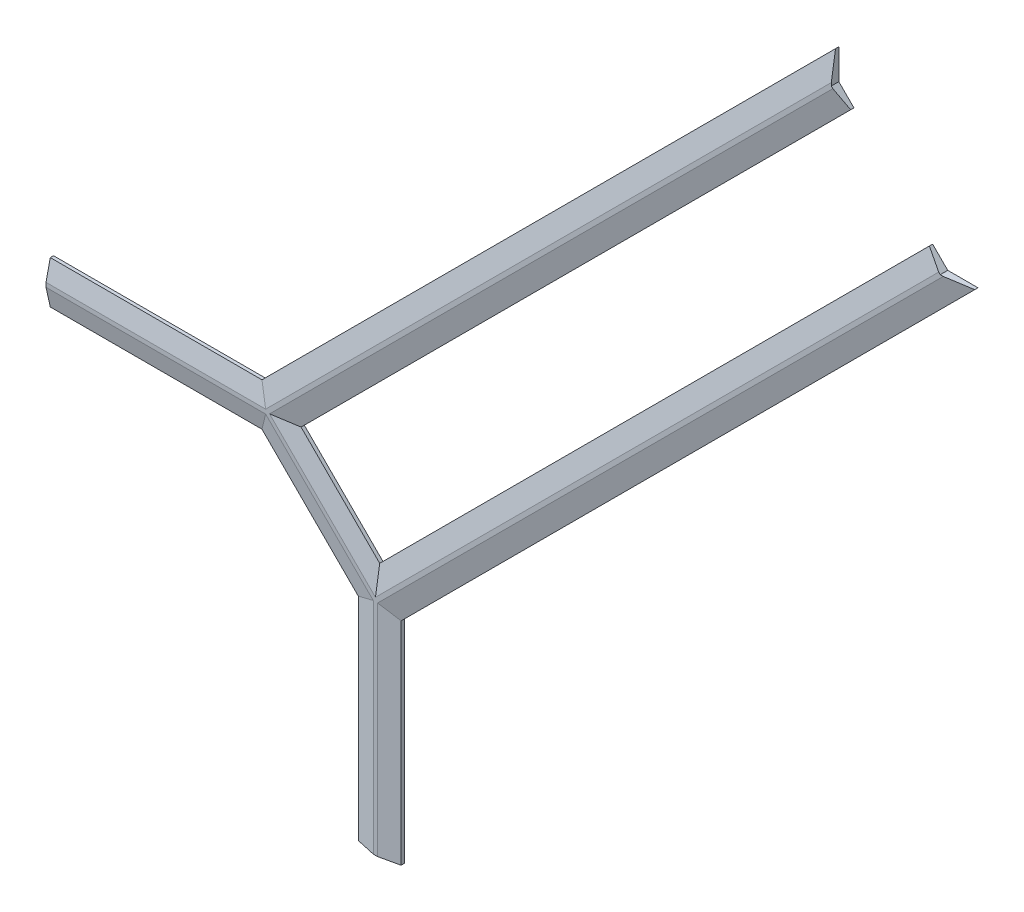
ISO-10303-21;
HEADER;
FILE_DESCRIPTION(('STEP AP214'),'2;1');
FILE_NAME('part.step','',(''),(''),'','','');
FILE_SCHEMA(('AUTOMOTIVE_DESIGN { 1 0 10303 214 1 1 1 1 }'));
ENDSEC;
DATA;
#1=APPLICATION_CONTEXT('core data for automotive mechanical design processes');
#2=APPLICATION_PROTOCOL_DEFINITION('international standard','automotive_design',2000,#1);
#3=PRODUCT_CONTEXT('',#1,'mechanical');
#4=PRODUCT('Part','Part','',(#3));
#5=PRODUCT_RELATED_PRODUCT_CATEGORY('part','',(#4));
#6=PRODUCT_DEFINITION_FORMATION('','',#4);
#7=PRODUCT_DEFINITION_CONTEXT('part definition',#1,'design');
#8=PRODUCT_DEFINITION('design','',#6,#7);
#9=PRODUCT_DEFINITION_SHAPE('','',#8);
#10=(LENGTH_UNIT() NAMED_UNIT(*) SI_UNIT(.MILLI.,.METRE.));
#11=(NAMED_UNIT(*) PLANE_ANGLE_UNIT() SI_UNIT($,.RADIAN.));
#12=(NAMED_UNIT(*) SI_UNIT($,.STERADIAN.) SOLID_ANGLE_UNIT());
#13=UNCERTAINTY_MEASURE_WITH_UNIT(LENGTH_MEASURE(1.E-05),#10,'distance_accuracy_value','');
#14=(GEOMETRIC_REPRESENTATION_CONTEXT(3) GLOBAL_UNCERTAINTY_ASSIGNED_CONTEXT((#13)) GLOBAL_UNIT_ASSIGNED_CONTEXT((#10,
#11,#12)) REPRESENTATION_CONTEXT('',''));
#15=CARTESIAN_POINT('',(0.,0.,0.));
#16=DIRECTION('',(0.,0.,1.));
#17=DIRECTION('',(1.,0.,0.));
#18=AXIS2_PLACEMENT_3D('',#15,#16,#17);
#19=CARTESIAN_POINT('',(807.010779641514,1220.1025612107,22.352));
#20=DIRECTION('',(-1.,1.1744786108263E-13,0.));
#21=DIRECTION('',(-1.1744786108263E-13,-1.,0.));
#22=AXIS2_PLACEMENT_3D('',#19,#20,#21);
#23=PLANE('',#22);
#24=DIRECTION('',(0.,0.,-1.));
#25=VECTOR('',#24,1.);
#26=CARTESIAN_POINT('',(807.010779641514,1220.1025612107,22.352));
#27=LINE('',#26,#25);
#28=CARTESIAN_POINT('',(807.010779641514,1220.1025612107,9.65199999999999));
#29=VERTEX_POINT('',#28);
#30=CARTESIAN_POINT('',(807.010779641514,1220.1025612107,0.));
#31=VERTEX_POINT('',#30);
#32=EDGE_CURVE('E293',#29,#31,#27,.T.);
#33=ORIENTED_EDGE('',*,*,#32,.F.);
#34=DIRECTION('',(-1.16024198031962E-13,-0.987878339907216,0.155230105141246));
#35=VECTOR('',#34,1.);
#36=CARTESIAN_POINT('',(807.010779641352,-160.272158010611,226.556961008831));
#37=LINE('',#36,#35);
#38=CARTESIAN_POINT('',(807.010779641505,1139.28025612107,22.3520000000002));
#39=VERTEX_POINT('',#38);
#40=EDGE_CURVE('E11',#29,#39,#37,.T.);
#41=ORIENTED_EDGE('',*,*,#40,.T.);
#42=DIRECTION('',(1.1744786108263E-13,1.,0.));
#43=VECTOR('',#42,1.);
#44=CARTESIAN_POINT('',(807.010779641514,1220.1025612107,22.352));
#45=LINE('',#44,#43);
#46=CARTESIAN_POINT('',(807.010779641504,1130.3,22.352));
#47=VERTEX_POINT('',#46);
#48=EDGE_CURVE('E266',#47,#39,#45,.T.);
#49=ORIENTED_EDGE('',*,*,#48,.F.);
#50=DIRECTION('',(0.,0.,-1.));
#51=VECTOR('',#50,1.);
#52=CARTESIAN_POINT('',(807.010779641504,1130.3,22.352));
#53=LINE('',#52,#51);
#54=CARTESIAN_POINT('',(807.010779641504,1130.3,0.));
#55=VERTEX_POINT('',#54);
#56=EDGE_CURVE('E217',#47,#55,#53,.T.);
#57=ORIENTED_EDGE('',*,*,#56,.T.);
#58=DIRECTION('',(1.1744786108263E-13,1.,0.));
#59=VECTOR('',#58,1.);
#60=CARTESIAN_POINT('',(807.010779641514,1220.1025612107,0.));
#61=LINE('',#60,#59);
#62=EDGE_CURVE('E221',#55,#31,#61,.T.);
#63=ORIENTED_EDGE('',*,*,#62,.T.);
#64=EDGE_LOOP('',(#33,#41,#49,#57,#63));
#65=FACE_BOUND('',#64,.T.);
#66=ADVANCED_FACE('F31',(#65),#23,.F.);
#67=CARTESIAN_POINT('',(807.010779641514,1220.1025612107,22.352));
#68=DIRECTION('',(0.707106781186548,-0.707106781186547,0.));
#69=DIRECTION('',(0.707106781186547,0.707106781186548,0.));
#70=AXIS2_PLACEMENT_3D('',#67,#68,#69);
#71=PLANE('',#70);
#72=DIRECTION('',(0.,0.,-1.));
#73=VECTOR('',#72,1.);
#74=CARTESIAN_POINT('',(-895.691781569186,-482.599999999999,22.352));
#75=LINE('',#74,#73);
#76=CARTESIAN_POINT('',(-895.691781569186,-482.599999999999,9.65199999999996));
#77=VERTEX_POINT('',#76);
#78=CARTESIAN_POINT('',(-895.691781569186,-482.599999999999,0.));
#79=VERTEX_POINT('',#78);
#80=EDGE_CURVE('E291',#77,#79,#75,.T.);
#81=ORIENTED_EDGE('',*,*,#80,.F.);
#82=DIRECTION('',(0.707106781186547,0.707106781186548,0.));
#83=VECTOR('',#82,1.);
#84=CARTESIAN_POINT('',(807.010779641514,1220.1025612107,9.65199999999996));
#85=LINE('',#84,#83);
#86=EDGE_CURVE('E40',#77,#29,#85,.T.);
#87=ORIENTED_EDGE('',*,*,#86,.T.);
#88=ORIENTED_EDGE('',*,*,#32,.T.);
#89=DIRECTION('',(-0.707106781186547,-0.707106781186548,0.));
#90=VECTOR('',#89,1.);
#91=CARTESIAN_POINT('',(807.010779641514,1220.1025612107,0.));
#92=LINE('',#91,#90);
#93=EDGE_CURVE('E224',#31,#79,#92,.T.);
#94=ORIENTED_EDGE('',*,*,#93,.T.);
#95=EDGE_LOOP('',(#81,#87,#88,#94));
#96=FACE_BOUND('',#95,.T.);
#97=ADVANCED_FACE('F412',(#96),#71,.F.);
#98=CARTESIAN_POINT('',(-1524.,-482.6,22.352));
#99=DIRECTION('',(0.,-1.,0.));
#100=DIRECTION('',(1.,0.,0.));
#101=AXIS2_PLACEMENT_3D('',#98,#99,#100);
#102=PLANE('',#101);
#103=DIRECTION('',(0.,0.,-1.));
#104=VECTOR('',#103,1.);
#105=CARTESIAN_POINT('',(-1524.,-482.6,22.352));
#106=LINE('',#105,#104);
#107=CARTESIAN_POINT('',(-1524.,-482.6,9.65199999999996));
#108=VERTEX_POINT('',#107);
#109=CARTESIAN_POINT('',(-1524.,-482.6,0.));
#110=VERTEX_POINT('',#109);
#111=EDGE_CURVE('E289',#108,#110,#106,.T.);
#112=ORIENTED_EDGE('',*,*,#111,.F.);
#113=DIRECTION('',(1.,0.,0.));
#114=VECTOR('',#113,1.);
#115=CARTESIAN_POINT('',(-895.691781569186,-482.599999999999,9.65199999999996));
#116=LINE('',#115,#114);
#117=EDGE_CURVE('E55',#108,#77,#116,.T.);
#118=ORIENTED_EDGE('',*,*,#117,.T.);
#119=ORIENTED_EDGE('',*,*,#80,.T.);
#120=DIRECTION('',(-1.,0.,0.));
#121=VECTOR('',#120,1.);
#122=CARTESIAN_POINT('',(-1524.,-482.6,0.));
#123=LINE('',#122,#121);
#124=EDGE_CURVE('E228',#79,#110,#123,.T.);
#125=ORIENTED_EDGE('',*,*,#124,.T.);
#126=EDGE_LOOP('',(#112,#118,#119,#125));
#127=FACE_BOUND('',#126,.T.);
#128=ADVANCED_FACE('F417',(#127),#102,.F.);
#129=CARTESIAN_POINT('',(-1524.,-482.6,22.352));
#130=DIRECTION('',(1.,0.,0.));
#131=DIRECTION('',(0.,0.,-1.));
#132=AXIS2_PLACEMENT_3D('',#129,#130,#131);
#133=PLANE('',#132);
#134=DIRECTION('',(0.,0.,-1.));
#135=VECTOR('',#134,1.);
#136=CARTESIAN_POINT('',(-1524.,-609.599999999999,22.352));
#137=LINE('',#136,#135);
#138=CARTESIAN_POINT('',(-1524.,-609.599999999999,9.65199999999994));
#139=VERTEX_POINT('',#138);
#140=CARTESIAN_POINT('',(-1524.,-609.599999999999,0.));
#141=VERTEX_POINT('',#140);
#142=EDGE_CURVE('E287',#139,#141,#137,.T.);
#143=ORIENTED_EDGE('',*,*,#142,.F.);
#144=DIRECTION('',(0.,0.976187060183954,0.216930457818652));
#145=VECTOR('',#144,1.);
#146=CARTESIAN_POINT('',(-1524.,-552.449999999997,22.3520000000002));
#147=LINE('',#146,#145);
#148=CARTESIAN_POINT('',(-1524.,-552.449999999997,22.352));
#149=VERTEX_POINT('',#148);
#150=EDGE_CURVE('E338',#139,#149,#147,.T.);
#151=ORIENTED_EDGE('',*,*,#150,.T.);
#152=DIRECTION('',(0.,-1.,0.));
#153=VECTOR('',#152,1.);
#154=CARTESIAN_POINT('',(-1524.,-482.6,22.352));
#155=LINE('',#154,#153);
#156=CARTESIAN_POINT('',(-1524.,-539.750000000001,22.352));
#157=VERTEX_POINT('',#156);
#158=EDGE_CURVE('E376',#157,#149,#155,.T.);
#159=ORIENTED_EDGE('',*,*,#158,.F.);
#160=DIRECTION('',(0.,0.976187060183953,-0.216930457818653));
#161=VECTOR('',#160,1.);
#162=CARTESIAN_POINT('',(-1524.,-539.75,22.3519999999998));
#163=LINE('',#162,#161);
#164=EDGE_CURVE('E336',#157,#108,#163,.T.);
#165=ORIENTED_EDGE('',*,*,#164,.T.);
#166=ORIENTED_EDGE('',*,*,#111,.T.);
#167=DIRECTION('',(0.,-1.,0.));
#168=VECTOR('',#167,1.);
#169=CARTESIAN_POINT('',(-1524.,-482.6,0.));
#170=LINE('',#169,#168);
#171=EDGE_CURVE('E231',#110,#141,#170,.T.);
#172=ORIENTED_EDGE('',*,*,#171,.T.);
#173=EDGE_LOOP('',(#143,#151,#159,#165,#166,#172));
#174=FACE_BOUND('',#173,.T.);
#175=ADVANCED_FACE('F449',(#174),#133,.F.);
#176=CARTESIAN_POINT('',(-1524.,-609.599999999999,22.352));
#177=DIRECTION('',(0.,1.,0.));
#178=DIRECTION('',(-1.,0.,0.));
#179=AXIS2_PLACEMENT_3D('',#176,#177,#178);
#180=PLANE('',#179);
#181=DIRECTION('',(0.,0.,-1.));
#182=VECTOR('',#181,1.);
#183=CARTESIAN_POINT('',(-895.691781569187,-609.599999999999,22.352));
#184=LINE('',#183,#182);
#185=CARTESIAN_POINT('',(-895.691781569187,-609.599999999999,9.65199999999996));
#186=VERTEX_POINT('',#185);
#187=CARTESIAN_POINT('',(-895.691781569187,-609.599999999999,0.));
#188=VERTEX_POINT('',#187);
#189=EDGE_CURVE('E285',#186,#188,#184,.T.);
#190=ORIENTED_EDGE('',*,*,#189,.F.);
#191=DIRECTION('',(-1.,0.,0.));
#192=VECTOR('',#191,1.);
#193=CARTESIAN_POINT('',(-1524.,-609.599999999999,9.65199999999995));
#194=LINE('',#193,#192);
#195=EDGE_CURVE('E334',#186,#139,#194,.T.);
#196=ORIENTED_EDGE('',*,*,#195,.T.);
#197=ORIENTED_EDGE('',*,*,#142,.T.);
#198=DIRECTION('',(1.,0.,0.));
#199=VECTOR('',#198,1.);
#200=CARTESIAN_POINT('',(-1524.,-609.599999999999,0.));
#201=LINE('',#200,#199);
#202=EDGE_CURVE('E234',#141,#188,#201,.T.);
#203=ORIENTED_EDGE('',*,*,#202,.T.);
#204=EDGE_LOOP('',(#190,#196,#197,#203));
#205=FACE_BOUND('',#204,.T.);
#206=ADVANCED_FACE('F486',(#205),#180,.F.);
#207=CARTESIAN_POINT('',(-895.691781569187,-609.599999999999,22.352));
#208=DIRECTION('',(0.707106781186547,0.707106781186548,0.));
#209=DIRECTION('',(-0.707106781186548,0.707106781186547,0.));
#210=AXIS2_PLACEMENT_3D('',#207,#208,#209);
#211=PLANE('',#210);
#212=DIRECTION('',(0.,0.,-1.));
#213=VECTOR('',#212,1.);
#214=CARTESIAN_POINT('',(-609.6,-895.691781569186,22.352));
#215=LINE('',#214,#213);
#216=CARTESIAN_POINT('',(-609.6,-895.691781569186,9.65199999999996));
#217=VERTEX_POINT('',#216);
#218=CARTESIAN_POINT('',(-609.6,-895.691781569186,0.));
#219=VERTEX_POINT('',#218);
#220=EDGE_CURVE('E283',#217,#219,#215,.T.);
#221=ORIENTED_EDGE('',*,*,#220,.F.);
#222=DIRECTION('',(-0.707106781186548,0.707106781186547,0.));
#223=VECTOR('',#222,1.);
#224=CARTESIAN_POINT('',(-895.691781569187,-609.599999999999,9.65199999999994));
#225=LINE('',#224,#223);
#226=EDGE_CURVE('E332',#217,#186,#225,.T.);
#227=ORIENTED_EDGE('',*,*,#226,.T.);
#228=ORIENTED_EDGE('',*,*,#189,.T.);
#229=DIRECTION('',(0.707106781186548,-0.707106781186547,0.));
#230=VECTOR('',#229,1.);
#231=CARTESIAN_POINT('',(-895.691781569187,-609.599999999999,0.));
#232=LINE('',#231,#230);
#233=EDGE_CURVE('E237',#188,#219,#232,.T.);
#234=ORIENTED_EDGE('',*,*,#233,.T.);
#235=EDGE_LOOP('',(#221,#227,#228,#234));
#236=FACE_BOUND('',#235,.T.);
#237=ADVANCED_FACE('F488',(#236),#211,.F.);
#238=CARTESIAN_POINT('',(-609.6,-895.691781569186,22.352));
#239=DIRECTION('',(1.,0.,0.));
#240=DIRECTION('',(0.,1.,0.));
#241=AXIS2_PLACEMENT_3D('',#238,#239,#240);
#242=PLANE('',#241);
#243=DIRECTION('',(0.,0.,-1.));
#244=VECTOR('',#243,1.);
#245=CARTESIAN_POINT('',(-609.6,-1524.,22.352));
#246=LINE('',#245,#244);
#247=CARTESIAN_POINT('',(-609.6,-1524.,9.65199999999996));
#248=VERTEX_POINT('',#247);
#249=CARTESIAN_POINT('',(-609.6,-1524.,0.));
#250=VERTEX_POINT('',#249);
#251=EDGE_CURVE('E281',#248,#250,#246,.T.);
#252=ORIENTED_EDGE('',*,*,#251,.F.);
#253=DIRECTION('',(0.,1.,0.));
#254=VECTOR('',#253,1.);
#255=CARTESIAN_POINT('',(-609.6,-895.691781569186,9.65199999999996));
#256=LINE('',#255,#254);
#257=EDGE_CURVE('E330',#248,#217,#256,.T.);
#258=ORIENTED_EDGE('',*,*,#257,.T.);
#259=ORIENTED_EDGE('',*,*,#220,.T.);
#260=DIRECTION('',(0.,-1.,0.));
#261=VECTOR('',#260,1.);
#262=CARTESIAN_POINT('',(-609.6,-895.691781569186,0.));
#263=LINE('',#262,#261);
#264=EDGE_CURVE('E240',#219,#250,#263,.T.);
#265=ORIENTED_EDGE('',*,*,#264,.T.);
#266=EDGE_LOOP('',(#252,#258,#259,#265));
#267=FACE_BOUND('',#266,.T.);
#268=ADVANCED_FACE('F456',(#267),#242,.F.);
#269=CARTESIAN_POINT('',(-609.6,-1524.,22.352));
#270=DIRECTION('',(0.,1.,0.));
#271=DIRECTION('',(0.,0.,1.));
#272=AXIS2_PLACEMENT_3D('',#269,#270,#271);
#273=PLANE('',#272);
#274=DIRECTION('',(1.,0.,0.));
#275=VECTOR('',#274,1.);
#276=CARTESIAN_POINT('',(-609.6,-1524.,22.352));
#277=LINE('',#276,#275);
#278=CARTESIAN_POINT('',(-552.449999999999,-1524.,22.352));
#279=VERTEX_POINT('',#278);
#280=CARTESIAN_POINT('',(-539.750000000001,-1524.,22.352));
#281=VERTEX_POINT('',#280);
#282=EDGE_CURVE('E198',#279,#281,#277,.T.);
#283=ORIENTED_EDGE('',*,*,#282,.F.);
#284=DIRECTION('',(-0.976187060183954,0.,-0.216930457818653));
#285=VECTOR('',#284,1.);
#286=CARTESIAN_POINT('',(-552.449999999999,-1524.,22.352));
#287=LINE('',#286,#285);
#288=EDGE_CURVE('E328',#279,#248,#287,.T.);
#289=ORIENTED_EDGE('',*,*,#288,.T.);
#290=ORIENTED_EDGE('',*,*,#251,.T.);
#291=DIRECTION('',(1.,0.,0.));
#292=VECTOR('',#291,1.);
#293=CARTESIAN_POINT('',(-609.6,-1524.,0.));
#294=LINE('',#293,#292);
#295=CARTESIAN_POINT('',(-482.6,-1524.,0.));
#296=VERTEX_POINT('',#295);
#297=EDGE_CURVE('E243',#250,#296,#294,.T.);
#298=ORIENTED_EDGE('',*,*,#297,.T.);
#299=DIRECTION('',(0.,0.,-1.));
#300=VECTOR('',#299,1.);
#301=CARTESIAN_POINT('',(-482.6,-1524.,22.352));
#302=LINE('',#301,#300);
#303=CARTESIAN_POINT('',(-482.6,-1524.,9.65199999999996));
#304=VERTEX_POINT('',#303);
#305=EDGE_CURVE('E279',#304,#296,#302,.T.);
#306=ORIENTED_EDGE('',*,*,#305,.F.);
#307=DIRECTION('',(-0.976187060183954,0.,0.216930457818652));
#308=VECTOR('',#307,1.);
#309=CARTESIAN_POINT('',(-539.750000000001,-1524.,22.352));
#310=LINE('',#309,#308);
#311=EDGE_CURVE('E326',#304,#281,#310,.T.);
#312=ORIENTED_EDGE('',*,*,#311,.T.);
#313=EDGE_LOOP('',(#283,#289,#290,#298,#306,#312));
#314=FACE_BOUND('',#313,.T.);
#315=ADVANCED_FACE('F387',(#314),#273,.F.);
#316=CARTESIAN_POINT('',(-482.6,-895.691781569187,22.352));
#317=DIRECTION('',(-1.,0.,0.));
#318=DIRECTION('',(0.,-1.,0.));
#319=AXIS2_PLACEMENT_3D('',#316,#317,#318);
#320=PLANE('',#319);
#321=DIRECTION('',(0.,0.,-1.));
#322=VECTOR('',#321,1.);
#323=CARTESIAN_POINT('',(-482.6,-895.691781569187,22.352));
#324=LINE('',#323,#322);
#325=CARTESIAN_POINT('',(-482.6,-895.691781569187,9.65199999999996));
#326=VERTEX_POINT('',#325);
#327=CARTESIAN_POINT('',(-482.6,-895.691781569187,0.));
#328=VERTEX_POINT('',#327);
#329=EDGE_CURVE('E277',#326,#328,#324,.T.);
#330=ORIENTED_EDGE('',*,*,#329,.F.);
#331=DIRECTION('',(0.,-1.,0.));
#332=VECTOR('',#331,1.);
#333=CARTESIAN_POINT('',(-482.6,-1524.,9.65199999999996));
#334=LINE('',#333,#332);
#335=EDGE_CURVE('E340',#326,#304,#334,.T.);
#336=ORIENTED_EDGE('',*,*,#335,.T.);
#337=ORIENTED_EDGE('',*,*,#305,.T.);
#338=DIRECTION('',(0.,1.,0.));
#339=VECTOR('',#338,1.);
#340=CARTESIAN_POINT('',(-482.6,-895.691781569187,0.));
#341=LINE('',#340,#339);
#342=EDGE_CURVE('E246',#296,#328,#341,.T.);
#343=ORIENTED_EDGE('',*,*,#342,.T.);
#344=EDGE_LOOP('',(#330,#336,#337,#343));
#345=FACE_BOUND('',#344,.T.);
#346=ADVANCED_FACE('F392',(#345),#320,.F.);
#347=CARTESIAN_POINT('',(1220.10256121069,807.010779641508,22.352));
#348=DIRECTION('',(-0.707106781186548,0.707106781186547,0.));
#349=DIRECTION('',(-0.707106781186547,-0.707106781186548,0.));
#350=AXIS2_PLACEMENT_3D('',#347,#348,#349);
#351=PLANE('',#350);
#352=DIRECTION('',(0.,0.,-1.));
#353=VECTOR('',#352,1.);
#354=CARTESIAN_POINT('',(1220.10256121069,807.010779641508,22.352));
#355=LINE('',#354,#353);
#356=CARTESIAN_POINT('',(1220.10256121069,807.010779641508,9.65199999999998));
#357=VERTEX_POINT('',#356);
#358=CARTESIAN_POINT('',(1220.10256121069,807.010779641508,0.));
#359=VERTEX_POINT('',#358);
#360=EDGE_CURVE('E208',#357,#359,#355,.T.);
#361=ORIENTED_EDGE('',*,*,#360,.F.);
#362=DIRECTION('',(-0.707106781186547,-0.707106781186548,0.));
#363=VECTOR('',#362,1.);
#364=CARTESIAN_POINT('',(-482.6,-895.691781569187,9.65199999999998));
#365=LINE('',#364,#363);
#366=EDGE_CURVE('E344',#357,#326,#365,.T.);
#367=ORIENTED_EDGE('',*,*,#366,.T.);
#368=ORIENTED_EDGE('',*,*,#329,.T.);
#369=DIRECTION('',(0.707106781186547,0.707106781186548,0.));
#370=VECTOR('',#369,1.);
#371=CARTESIAN_POINT('',(1220.10256121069,807.010779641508,0.));
#372=LINE('',#371,#370);
#373=EDGE_CURVE('E249',#328,#359,#372,.T.);
#374=ORIENTED_EDGE('',*,*,#373,.T.);
#375=EDGE_LOOP('',(#361,#367,#368,#374));
#376=FACE_BOUND('',#375,.T.);
#377=ADVANCED_FACE('F396',(#376),#351,.F.);
#378=CARTESIAN_POINT('',(1130.3,807.010779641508,22.352));
#379=DIRECTION('',(0.,-1.,0.));
#380=DIRECTION('',(1.,0.,0.));
#381=AXIS2_PLACEMENT_3D('',#378,#379,#380);
#382=PLANE('',#381);
#383=DIRECTION('',(-1.,0.,0.));
#384=VECTOR('',#383,1.);
#385=CARTESIAN_POINT('',(1130.3,807.010779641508,22.352));
#386=LINE('',#385,#384);
#387=CARTESIAN_POINT('',(1139.28025612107,807.010779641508,22.3519999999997));
#388=VERTEX_POINT('',#387);
#389=CARTESIAN_POINT('',(1130.3,807.010779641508,22.352));
#390=VERTEX_POINT('',#389);
#391=EDGE_CURVE('E187',#388,#390,#386,.T.);
#392=ORIENTED_EDGE('',*,*,#391,.F.);
#393=DIRECTION('',(0.987878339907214,0.,-0.155230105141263));
#394=VECTOR('',#393,1.);
#395=CARTESIAN_POINT('',(-160.272158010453,807.010779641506,226.556961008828));
#396=LINE('',#395,#394);
#397=EDGE_CURVE('E342',#388,#357,#396,.T.);
#398=ORIENTED_EDGE('',*,*,#397,.T.);
#399=ORIENTED_EDGE('',*,*,#360,.T.);
#400=DIRECTION('',(-1.,0.,0.));
#401=VECTOR('',#400,1.);
#402=CARTESIAN_POINT('',(1130.3,807.010779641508,0.));
#403=LINE('',#402,#401);
#404=CARTESIAN_POINT('',(1130.3,807.010779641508,0.));
#405=VERTEX_POINT('',#404);
#406=EDGE_CURVE('E204',#359,#405,#403,.T.);
#407=ORIENTED_EDGE('',*,*,#406,.T.);
#408=DIRECTION('',(0.,0.,-1.));
#409=VECTOR('',#408,1.);
#410=CARTESIAN_POINT('',(1130.3,807.010779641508,22.352));
#411=LINE('',#410,#409);
#412=EDGE_CURVE('E201',#390,#405,#411,.T.);
#413=ORIENTED_EDGE('',*,*,#412,.F.);
#414=EDGE_LOOP('',(#392,#398,#399,#407,#413));
#415=FACE_BOUND('',#414,.T.);
#416=ADVANCED_FACE('F202',(#415),#382,.F.);
#417=CARTESIAN_POINT('',(1085.39871939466,851.912060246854,22.352));
#418=DIRECTION('',(-0.707106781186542,-0.707106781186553,0.));
#419=DIRECTION('',(0.707106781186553,-0.707106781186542,0.));
#420=AXIS2_PLACEMENT_3D('',#417,#418,#419);
#421=PLANE('',#420);
#422=DIRECTION('',(0.,0.,-1.));
#423=VECTOR('',#422,1.);
#424=CARTESIAN_POINT('',(1085.39871939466,851.912060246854,22.352));
#425=LINE('',#424,#423);
#426=CARTESIAN_POINT('',(1085.39871939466,851.912060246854,9.6519999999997));
#427=VERTEX_POINT('',#426);
#428=CARTESIAN_POINT('',(1085.39871939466,851.912060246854,0.));
#429=VERTEX_POINT('',#428);
#430=EDGE_CURVE('E209',#427,#429,#425,.T.);
#431=ORIENTED_EDGE('',*,*,#430,.F.);
#432=DIRECTION('',(0.690268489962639,-0.690268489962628,0.216930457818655));
#433=VECTOR('',#432,1.);
#434=CARTESIAN_POINT('',(1125.80987193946,811.50090770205,22.3519999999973));
#435=LINE('',#434,#433);
#436=CARTESIAN_POINT('',(1125.80987193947,811.500907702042,22.352));
#437=VERTEX_POINT('',#436);
#438=EDGE_CURVE('E214',#427,#437,#435,.T.);
#439=ORIENTED_EDGE('',*,*,#438,.T.);
#440=DIRECTION('',(-0.707106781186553,0.707106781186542,0.));
#441=VECTOR('',#440,1.);
#442=CARTESIAN_POINT('',(1085.39871939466,851.912060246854,22.352));
#443=LINE('',#442,#441);
#444=EDGE_CURVE('E191',#390,#437,#443,.T.);
#445=ORIENTED_EDGE('',*,*,#444,.F.);
#446=ORIENTED_EDGE('',*,*,#412,.T.);
#447=DIRECTION('',(-0.707106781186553,0.707106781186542,0.));
#448=VECTOR('',#447,1.);
#449=CARTESIAN_POINT('',(1085.39871939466,851.912060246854,0.));
#450=LINE('',#449,#448);
#451=EDGE_CURVE('E253',#405,#429,#450,.T.);
#452=ORIENTED_EDGE('',*,*,#451,.T.);
#453=EDGE_LOOP('',(#431,#439,#445,#446,#452));
#454=FACE_BOUND('',#453,.T.);
#455=ADVANCED_FACE('F212',(#454),#421,.F.);
#456=CARTESIAN_POINT('',(1040.49743878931,807.010779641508,22.352));
#457=DIRECTION('',(0.707106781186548,-0.707106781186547,0.));
#458=DIRECTION('',(0.707106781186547,0.707106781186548,0.));
#459=AXIS2_PLACEMENT_3D('',#456,#457,#458);
#460=PLANE('',#459);
#461=DIRECTION('',(0.,0.,-1.));
#462=VECTOR('',#461,1.);
#463=CARTESIAN_POINT('',(-546.1,-779.586659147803,22.352));
#464=LINE('',#463,#462);
#465=CARTESIAN_POINT('',(-546.1,-779.586659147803,9.65199999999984));
#466=VERTEX_POINT('',#465);
#467=CARTESIAN_POINT('',(-546.1,-779.586659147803,0.));
#468=VERTEX_POINT('',#467);
#469=EDGE_CURVE('E273',#466,#468,#464,.T.);
#470=ORIENTED_EDGE('',*,*,#469,.F.);
#471=DIRECTION('',(0.707106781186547,0.707106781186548,0.));
#472=VECTOR('',#471,1.);
#473=CARTESIAN_POINT('',(1085.39871939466,851.912060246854,9.65199999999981));
#474=LINE('',#473,#472);
#475=EDGE_CURVE('E321',#466,#427,#474,.T.);
#476=ORIENTED_EDGE('',*,*,#475,.T.);
#477=ORIENTED_EDGE('',*,*,#430,.T.);
#478=DIRECTION('',(-0.707106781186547,-0.707106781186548,0.));
#479=VECTOR('',#478,1.);
#480=CARTESIAN_POINT('',(1040.49743878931,807.010779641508,0.));
#481=LINE('',#480,#479);
#482=EDGE_CURVE('E255',#429,#468,#481,.T.);
#483=ORIENTED_EDGE('',*,*,#482,.T.);
#484=EDGE_LOOP('',(#470,#476,#477,#483));
#485=FACE_BOUND('',#484,.T.);
#486=ADVANCED_FACE('F563',(#485),#460,.F.);
#487=CARTESIAN_POINT('',(-779.586659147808,-546.1,22.352));
#488=DIRECTION('',(-0.707106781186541,-0.707106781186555,0.));
#489=DIRECTION('',(0.707106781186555,-0.707106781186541,0.));
#490=AXIS2_PLACEMENT_3D('',#487,#488,#489);
#491=PLANE('',#490);
#492=DIRECTION('',(0.,0.,-1.));
#493=VECTOR('',#492,1.);
#494=CARTESIAN_POINT('',(-779.586659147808,-546.1,22.352));
#495=LINE('',#494,#493);
#496=CARTESIAN_POINT('',(-779.586659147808,-546.1,9.65199999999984));
#497=VERTEX_POINT('',#496);
#498=CARTESIAN_POINT('',(-779.586659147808,-546.1,0.));
#499=VERTEX_POINT('',#498);
#500=EDGE_CURVE('E271',#497,#499,#495,.T.);
#501=ORIENTED_EDGE('',*,*,#500,.F.);
#502=DIRECTION('',(0.707106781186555,-0.707106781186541,0.));
#503=VECTOR('',#502,1.);
#504=CARTESIAN_POINT('',(-546.1,-779.586659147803,9.65199999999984));
#505=LINE('',#504,#503);
#506=EDGE_CURVE('E324',#497,#466,#505,.T.);
#507=ORIENTED_EDGE('',*,*,#506,.T.);
#508=ORIENTED_EDGE('',*,*,#469,.T.);
#509=DIRECTION('',(-0.707106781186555,0.70710678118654,0.));
#510=VECTOR('',#509,1.);
#511=CARTESIAN_POINT('',(-779.586659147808,-546.1,0.));
#512=LINE('',#511,#510);
#513=EDGE_CURVE('E258',#468,#499,#512,.T.);
#514=ORIENTED_EDGE('',*,*,#513,.T.);
#515=EDGE_LOOP('',(#501,#507,#508,#514));
#516=FACE_BOUND('',#515,.T.);
#517=ADVANCED_FACE('F573',(#516),#491,.F.);
#518=CARTESIAN_POINT('',(807.010779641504,1040.49743878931,22.352));
#519=DIRECTION('',(-0.707106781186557,0.707106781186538,0.));
#520=DIRECTION('',(-0.707106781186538,-0.707106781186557,0.));
#521=AXIS2_PLACEMENT_3D('',#518,#519,#520);
#522=PLANE('',#521);
#523=DIRECTION('',(0.,0.,-1.));
#524=VECTOR('',#523,1.);
#525=CARTESIAN_POINT('',(851.912060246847,1085.39871939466,22.352));
#526=LINE('',#525,#524);
#527=CARTESIAN_POINT('',(851.912060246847,1085.39871939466,9.65199999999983));
#528=VERTEX_POINT('',#527);
#529=CARTESIAN_POINT('',(851.912060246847,1085.39871939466,0.));
#530=VERTEX_POINT('',#529);
#531=EDGE_CURVE('E269',#528,#530,#526,.T.);
#532=ORIENTED_EDGE('',*,*,#531,.F.);
#533=DIRECTION('',(-0.707106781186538,-0.707106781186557,0.));
#534=VECTOR('',#533,1.);
#535=CARTESIAN_POINT('',(-779.586659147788,-546.10000000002,9.65199999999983));
#536=LINE('',#535,#534);
#537=EDGE_CURVE('E319',#528,#497,#536,.T.);
#538=ORIENTED_EDGE('',*,*,#537,.T.);
#539=ORIENTED_EDGE('',*,*,#500,.T.);
#540=DIRECTION('',(0.707106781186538,0.707106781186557,0.));
#541=VECTOR('',#540,1.);
#542=CARTESIAN_POINT('',(807.010779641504,1040.49743878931,0.));
#543=LINE('',#542,#541);
#544=EDGE_CURVE('E261',#499,#530,#543,.T.);
#545=ORIENTED_EDGE('',*,*,#544,.T.);
#546=EDGE_LOOP('',(#532,#538,#539,#545));
#547=FACE_BOUND('',#546,.T.);
#548=ADVANCED_FACE('F476',(#547),#522,.F.);
#549=CARTESIAN_POINT('',(807.010779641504,1130.3,22.352));
#550=DIRECTION('',(-0.707106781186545,-0.70710678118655,0.));
#551=DIRECTION('',(0.70710678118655,-0.707106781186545,0.));
#552=AXIS2_PLACEMENT_3D('',#549,#550,#551);
#553=PLANE('',#552);
#554=DIRECTION('',(-0.70710678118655,0.707106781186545,0.));
#555=VECTOR('',#554,1.);
#556=CARTESIAN_POINT('',(807.010779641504,1130.3,22.352));
#557=LINE('',#556,#555);
#558=CARTESIAN_POINT('',(811.500907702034,1125.80987193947,22.352));
#559=VERTEX_POINT('',#558);
#560=EDGE_CURVE('E215',#559,#47,#557,.T.);
#561=ORIENTED_EDGE('',*,*,#560,.F.);
#562=DIRECTION('',(0.690268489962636,-0.690268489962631,-0.216930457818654));
#563=VECTOR('',#562,1.);
#564=CARTESIAN_POINT('',(811.500907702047,1125.80987193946,22.3519999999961));
#565=LINE('',#564,#563);
#566=EDGE_CURVE('E317',#559,#528,#565,.T.);
#567=ORIENTED_EDGE('',*,*,#566,.T.);
#568=ORIENTED_EDGE('',*,*,#531,.T.);
#569=DIRECTION('',(-0.70710678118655,0.707106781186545,0.));
#570=VECTOR('',#569,1.);
#571=CARTESIAN_POINT('',(807.010779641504,1130.3,0.));
#572=LINE('',#571,#570);
#573=EDGE_CURVE('E264',#530,#55,#572,.T.);
#574=ORIENTED_EDGE('',*,*,#573,.T.);
#575=ORIENTED_EDGE('',*,*,#56,.F.);
#576=EDGE_LOOP('',(#561,#567,#568,#574,#575));
#577=FACE_BOUND('',#576,.T.);
#578=ADVANCED_FACE('F474',(#577),#553,.F.);
#579=CARTESIAN_POINT('',(807.010779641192,-1524.,22.352));
#580=DIRECTION('',(0.,0.,1.));
#581=DIRECTION('',(1.,0.,0.));
#582=AXIS2_PLACEMENT_3D('',#579,#580,#581);
#583=PLANE('',#582);
#584=DIRECTION('',(-0.707106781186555,0.70710678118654,0.));
#585=VECTOR('',#584,1.);
#586=CARTESIAN_POINT('',(-819.99781169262,-586.511152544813,22.352));
#587=LINE('',#586,#585);
#588=CARTESIAN_POINT('',(-546.099999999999,-860.408964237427,22.352));
#589=VERTEX_POINT('',#588);
#590=CARTESIAN_POINT('',(-860.408964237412,-546.100000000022,22.352));
#591=VERTEX_POINT('',#590);
#592=EDGE_CURVE('E310',#589,#591,#587,.T.);
#593=ORIENTED_EDGE('',*,*,#592,.T.);
#594=DIRECTION('',(0.707106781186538,0.707106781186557,0.));
#595=VECTOR('',#594,1.);
#596=CARTESIAN_POINT('',(811.500907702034,1125.80987193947,22.352));
#597=LINE('',#596,#595);
#598=EDGE_CURVE('E314',#591,#559,#597,.T.);
#599=ORIENTED_EDGE('',*,*,#598,.T.);
#600=ORIENTED_EDGE('',*,*,#560,.T.);
#601=ORIENTED_EDGE('',*,*,#48,.T.);
#602=DIRECTION('',(-0.707106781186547,-0.707106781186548,0.));
#603=VECTOR('',#602,1.);
#604=CARTESIAN_POINT('',(-855.280629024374,-523.011152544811,22.352));
#605=LINE('',#604,#603);
#606=CARTESIAN_POINT('',(-872.019476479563,-539.75,22.352));
#607=VERTEX_POINT('',#606);
#608=EDGE_CURVE('E295',#39,#607,#605,.T.);
#609=ORIENTED_EDGE('',*,*,#608,.T.);
#610=DIRECTION('',(-1.,0.,0.));
#611=VECTOR('',#610,1.);
#612=CARTESIAN_POINT('',(-1524.,-539.750000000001,22.352));
#613=LINE('',#612,#611);
#614=EDGE_CURVE('E297',#607,#157,#613,.T.);
#615=ORIENTED_EDGE('',*,*,#614,.T.);
#616=ORIENTED_EDGE('',*,*,#158,.T.);
#617=DIRECTION('',(1.,0.,0.));
#618=VECTOR('',#617,1.);
#619=CARTESIAN_POINT('',(-895.691781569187,-552.449999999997,22.352));
#620=LINE('',#619,#618);
#621=CARTESIAN_POINT('',(-872.019476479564,-552.449999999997,22.352));
#622=VERTEX_POINT('',#621);
#623=EDGE_CURVE('E303',#149,#622,#620,.T.);
#624=ORIENTED_EDGE('',*,*,#623,.T.);
#625=DIRECTION('',(0.707106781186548,-0.707106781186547,0.));
#626=VECTOR('',#625,1.);
#627=CARTESIAN_POINT('',(-569.188847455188,-855.280629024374,22.352));
#628=LINE('',#627,#626);
#629=CARTESIAN_POINT('',(-552.449999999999,-872.019476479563,22.352));
#630=VERTEX_POINT('',#629);
#631=EDGE_CURVE('E305',#622,#630,#628,.T.);
#632=ORIENTED_EDGE('',*,*,#631,.T.);
#633=DIRECTION('',(0.,-1.,0.));
#634=VECTOR('',#633,1.);
#635=CARTESIAN_POINT('',(-552.449999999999,-1524.,22.352));
#636=LINE('',#635,#634);
#637=EDGE_CURVE('E307',#630,#279,#636,.T.);
#638=ORIENTED_EDGE('',*,*,#637,.T.);
#639=ORIENTED_EDGE('',*,*,#282,.T.);
#640=DIRECTION('',(0.,1.,0.));
#641=VECTOR('',#640,1.);
#642=CARTESIAN_POINT('',(-539.750000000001,-895.691781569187,22.352));
#643=LINE('',#642,#641);
#644=CARTESIAN_POINT('',(-539.750000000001,-872.019476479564,22.352));
#645=VERTEX_POINT('',#644);
#646=EDGE_CURVE('E301',#281,#645,#643,.T.);
#647=ORIENTED_EDGE('',*,*,#646,.T.);
#648=DIRECTION('',(0.707106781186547,0.707106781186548,0.));
#649=VECTOR('',#648,1.);
#650=CARTESIAN_POINT('',(1179.69140866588,847.42193218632,22.352));
#651=LINE('',#650,#649);
#652=EDGE_CURVE('E195',#645,#388,#651,.T.);
#653=ORIENTED_EDGE('',*,*,#652,.T.);
#654=ORIENTED_EDGE('',*,*,#391,.T.);
#655=ORIENTED_EDGE('',*,*,#444,.T.);
#656=DIRECTION('',(-0.707106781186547,-0.707106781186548,0.));
#657=VECTOR('',#656,1.);
#658=CARTESIAN_POINT('',(-505.688847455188,-819.997811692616,22.352));
#659=LINE('',#658,#657);
#660=EDGE_CURVE('E312',#437,#589,#659,.T.);
#661=ORIENTED_EDGE('',*,*,#660,.T.);
#662=EDGE_LOOP('',(#593,#599,#600,#601,#609,#615,#616,#624,#632,#638,#639,#647,#653,#654,#655,#661));
#663=FACE_BOUND('',#662,.T.);
#664=ADVANCED_FACE('F189',(#663),#583,.T.);
#665=CARTESIAN_POINT('',(807.010779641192,-1524.,0.));
#666=DIRECTION('',(0.,0.,1.));
#667=DIRECTION('',(1.,0.,0.));
#668=AXIS2_PLACEMENT_3D('',#665,#666,#667);
#669=PLANE('',#668);
#670=ORIENTED_EDGE('',*,*,#62,.F.);
#671=ORIENTED_EDGE('',*,*,#573,.F.);
#672=ORIENTED_EDGE('',*,*,#544,.F.);
#673=ORIENTED_EDGE('',*,*,#513,.F.);
#674=ORIENTED_EDGE('',*,*,#482,.F.);
#675=ORIENTED_EDGE('',*,*,#451,.F.);
#676=ORIENTED_EDGE('',*,*,#406,.F.);
#677=ORIENTED_EDGE('',*,*,#373,.F.);
#678=ORIENTED_EDGE('',*,*,#342,.F.);
#679=ORIENTED_EDGE('',*,*,#297,.F.);
#680=ORIENTED_EDGE('',*,*,#264,.F.);
#681=ORIENTED_EDGE('',*,*,#233,.F.);
#682=ORIENTED_EDGE('',*,*,#202,.F.);
#683=ORIENTED_EDGE('',*,*,#171,.F.);
#684=ORIENTED_EDGE('',*,*,#124,.F.);
#685=ORIENTED_EDGE('',*,*,#93,.F.);
#686=EDGE_LOOP('',(#670,#671,#672,#673,#674,#675,#676,#677,#678,#679,#680,#681,#682,#683,#684,#685));
#687=FACE_BOUND('',#686,.T.);
#688=ADVANCED_FACE('F432',(#687),#669,.F.);
#689=CARTESIAN_POINT('',(-201.340128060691,-515.649092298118,22.352));
#690=DIRECTION('',(-0.153392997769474,0.153392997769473,0.976187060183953));
#691=DIRECTION('',(0.987878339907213,0.,0.155230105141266));
#692=AXIS2_PLACEMENT_3D('',#689,#690,#691);
#693=PLANE('',#692);
#694=ORIENTED_EDGE('',*,*,#438,.F.);
#695=ORIENTED_EDGE('',*,*,#475,.F.);
#696=DIRECTION('',(0.,0.987878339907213,-0.155230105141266));
#697=VECTOR('',#696,1.);
#698=CARTESIAN_POINT('',(-546.1,-523.956559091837,-30.5163949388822));
#699=LINE('',#698,#697);
#700=EDGE_CURVE('E225',#589,#466,#699,.T.);
#701=ORIENTED_EDGE('',*,*,#700,.F.);
#702=ORIENTED_EDGE('',*,*,#660,.F.);
#703=EDGE_LOOP('',(#694,#695,#701,#702));
#704=FACE_BOUND('',#703,.T.);
#705=ADVANCED_FACE('F429',(#704),#693,.T.);
#706=CARTESIAN_POINT('',(462.250907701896,-1868.7598719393,22.352));
#707=DIRECTION('',(0.153392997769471,0.153392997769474,0.976187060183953));
#708=DIRECTION('',(0.,-0.987878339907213,0.155230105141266));
#709=AXIS2_PLACEMENT_3D('',#706,#707,#708);
#710=PLANE('',#709);
#711=ORIENTED_EDGE('',*,*,#700,.T.);
#712=ORIENTED_EDGE('',*,*,#506,.F.);
#713=DIRECTION('',(-0.987878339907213,0.,0.155230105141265));
#714=VECTOR('',#713,1.);
#715=CARTESIAN_POINT('',(-523.956559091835,-546.100000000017,-30.5163949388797));
#716=LINE('',#715,#714);
#717=EDGE_CURVE('E348',#591,#497,#716,.F.);
#718=ORIENTED_EDGE('',*,*,#717,.F.);
#719=ORIENTED_EDGE('',*,*,#592,.F.);
#720=EDGE_LOOP('',(#711,#712,#718,#719));
#721=FACE_BOUND('',#720,.T.);
#722=ADVANCED_FACE('F425',(#721),#710,.T.);
#723=CARTESIAN_POINT('',(-515.649092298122,-201.340128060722,22.352));
#724=DIRECTION('',(0.153392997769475,-0.153392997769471,0.976187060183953));
#725=DIRECTION('',(0.987878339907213,0.,-0.155230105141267));
#726=AXIS2_PLACEMENT_3D('',#723,#724,#725);
#727=PLANE('',#726);
#728=ORIENTED_EDGE('',*,*,#717,.T.);
#729=ORIENTED_EDGE('',*,*,#537,.F.);
#730=ORIENTED_EDGE('',*,*,#566,.F.);
#731=ORIENTED_EDGE('',*,*,#598,.F.);
#732=EDGE_LOOP('',(#728,#729,#730,#731));
#733=FACE_BOUND('',#732,.T.);
#734=ADVANCED_FACE('F421',(#733),#727,.T.);
#735=CARTESIAN_POINT('',(807.010779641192,-552.449999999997,22.352));
#736=DIRECTION('',(0.,-0.216930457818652,0.976187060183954));
#737=DIRECTION('',(0.,-0.976187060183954,-0.216930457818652));
#738=AXIS2_PLACEMENT_3D('',#735,#736,#737);
#739=PLANE('',#738);
#740=ORIENTED_EDGE('',*,*,#150,.F.);
#741=ORIENTED_EDGE('',*,*,#195,.F.);
#742=DIRECTION('',(0.374864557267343,0.905003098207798,0.201111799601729));
#743=VECTOR('',#742,1.);
#744=CARTESIAN_POINT('',(-1135.39458168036,-1188.29375096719,-118.94661132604));
#745=LINE('',#744,#743);
#746=EDGE_CURVE('E351',#622,#186,#745,.F.);
#747=ORIENTED_EDGE('',*,*,#746,.F.);
#748=ORIENTED_EDGE('',*,*,#623,.F.);
#749=EDGE_LOOP('',(#740,#741,#747,#748));
#750=FACE_BOUND('',#749,.T.);
#751=ADVANCED_FACE('F424',(#750),#739,.T.);
#752=CARTESIAN_POINT('',(453.270651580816,-1877.74012806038,22.352));
#753=DIRECTION('',(-0.153392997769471,-0.153392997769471,0.976187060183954));
#754=DIRECTION('',(0.,-0.987878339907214,-0.155230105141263));
#755=AXIS2_PLACEMENT_3D('',#752,#753,#754);
#756=PLANE('',#755);
#757=ORIENTED_EDGE('',*,*,#746,.T.);
#758=ORIENTED_EDGE('',*,*,#226,.F.);
#759=DIRECTION('',(0.905003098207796,0.374864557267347,0.201111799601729));
#760=VECTOR('',#759,1.);
#761=CARTESIAN_POINT('',(-773.636730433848,-963.638020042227,-26.8006067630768));
#762=LINE('',#761,#760);
#763=EDGE_CURVE('E354',#630,#217,#762,.F.);
#764=ORIENTED_EDGE('',*,*,#763,.F.);
#765=ORIENTED_EDGE('',*,*,#631,.F.);
#766=EDGE_LOOP('',(#757,#758,#764,#765));
#767=FACE_BOUND('',#766,.T.);
#768=ADVANCED_FACE('F408',(#767),#756,.T.);
#769=CARTESIAN_POINT('',(-552.449999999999,-1524.,22.352));
#770=DIRECTION('',(-0.216930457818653,0.,0.976187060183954));
#771=DIRECTION('',(0.976187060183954,0.,0.216930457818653));
#772=AXIS2_PLACEMENT_3D('',#769,#770,#771);
#773=PLANE('',#772);
#774=ORIENTED_EDGE('',*,*,#763,.T.);
#775=ORIENTED_EDGE('',*,*,#257,.F.);
#776=ORIENTED_EDGE('',*,*,#288,.F.);
#777=ORIENTED_EDGE('',*,*,#637,.F.);
#778=EDGE_LOOP('',(#774,#775,#776,#777));
#779=FACE_BOUND('',#778,.T.);
#780=ADVANCED_FACE('F401',(#779),#773,.T.);
#781=CARTESIAN_POINT('',(-192.359871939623,-524.629348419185,22.352));
#782=DIRECTION('',(0.153392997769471,-0.15339299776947,0.976187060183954));
#783=DIRECTION('',(0.987878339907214,0.,-0.155230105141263));
#784=AXIS2_PLACEMENT_3D('',#781,#782,#783);
#785=PLANE('',#784);
#786=ORIENTED_EDGE('',*,*,#397,.F.);
#787=ORIENTED_EDGE('',*,*,#652,.F.);
#788=DIRECTION('',(0.905003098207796,-0.374864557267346,-0.201111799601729));
#789=VECTOR('',#788,1.);
#790=CARTESIAN_POINT('',(-318.563269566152,-963.638020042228,-26.8006067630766));
#791=LINE('',#790,#789);
#792=EDGE_CURVE('E357',#326,#645,#791,.F.);
#793=ORIENTED_EDGE('',*,*,#792,.F.);
#794=ORIENTED_EDGE('',*,*,#366,.F.);
#795=EDGE_LOOP('',(#786,#787,#793,#794));
#796=FACE_BOUND('',#795,.T.);
#797=ADVANCED_FACE('F399',(#796),#785,.T.);
#798=CARTESIAN_POINT('',(-539.750000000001,-1524.,22.352));
#799=DIRECTION('',(0.216930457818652,0.,0.976187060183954));
#800=DIRECTION('',(0.976187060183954,0.,-0.216930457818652));
#801=AXIS2_PLACEMENT_3D('',#798,#799,#800);
#802=PLANE('',#801);
#803=ORIENTED_EDGE('',*,*,#311,.F.);
#804=ORIENTED_EDGE('',*,*,#335,.F.);
#805=ORIENTED_EDGE('',*,*,#792,.T.);
#806=ORIENTED_EDGE('',*,*,#646,.F.);
#807=EDGE_LOOP('',(#803,#804,#805,#806));
#808=FACE_BOUND('',#807,.T.);
#809=ADVANCED_FACE('F385',(#808),#802,.T.);
#810=CARTESIAN_POINT('',(-524.629348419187,-192.359871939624,22.352));
#811=DIRECTION('',(-0.153392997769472,0.153392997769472,0.976187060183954));
#812=DIRECTION('',(0.987878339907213,0.,0.155230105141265));
#813=AXIS2_PLACEMENT_3D('',#810,#811,#812);
#814=PLANE('',#813);
#815=ORIENTED_EDGE('',*,*,#40,.F.);
#816=ORIENTED_EDGE('',*,*,#86,.F.);
#817=DIRECTION('',(0.374864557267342,-0.905003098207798,0.20111179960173));
#818=VECTOR('',#817,1.);
#819=CARTESIAN_POINT('',(-636.076375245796,-1109.36703494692,148.933563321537));
#820=LINE('',#819,#818);
#821=EDGE_CURVE('E35',#607,#77,#820,.F.);
#822=ORIENTED_EDGE('',*,*,#821,.F.);
#823=ORIENTED_EDGE('',*,*,#608,.F.);
#824=EDGE_LOOP('',(#815,#816,#822,#823));
#825=FACE_BOUND('',#824,.T.);
#826=ADVANCED_FACE('F33',(#825),#814,.T.);
#827=CARTESIAN_POINT('',(807.010779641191,-539.75,22.352));
#828=DIRECTION('',(0.,0.216930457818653,0.976187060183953));
#829=DIRECTION('',(0.,-0.976187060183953,0.216930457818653));
#830=AXIS2_PLACEMENT_3D('',#827,#828,#829);
#831=PLANE('',#830);
#832=ORIENTED_EDGE('',*,*,#821,.T.);
#833=ORIENTED_EDGE('',*,*,#117,.F.);
#834=ORIENTED_EDGE('',*,*,#164,.F.);
#835=ORIENTED_EDGE('',*,*,#614,.F.);
#836=EDGE_LOOP('',(#832,#833,#834,#835));
#837=FACE_BOUND('',#836,.T.);
#838=ADVANCED_FACE('F367',(#837),#831,.T.);
#839=CLOSED_SHELL('',(#66,#97,#128,#175,#206,#237,#268,#315,#346,#377,#416,#455,#486,#517,#548,
#578,#664,#688,#705,#722,#734,#751,#768,#780,#797,#809,#826,#838));
#840=MANIFOLD_SOLID_BREP('B2',#839);
#841=ADVANCED_BREP_SHAPE_REPRESENTATION('',(#18,#840),#14);
#842=SHAPE_DEFINITION_REPRESENTATION(#9,#841);
ENDSEC;
END-ISO-10303-21;
